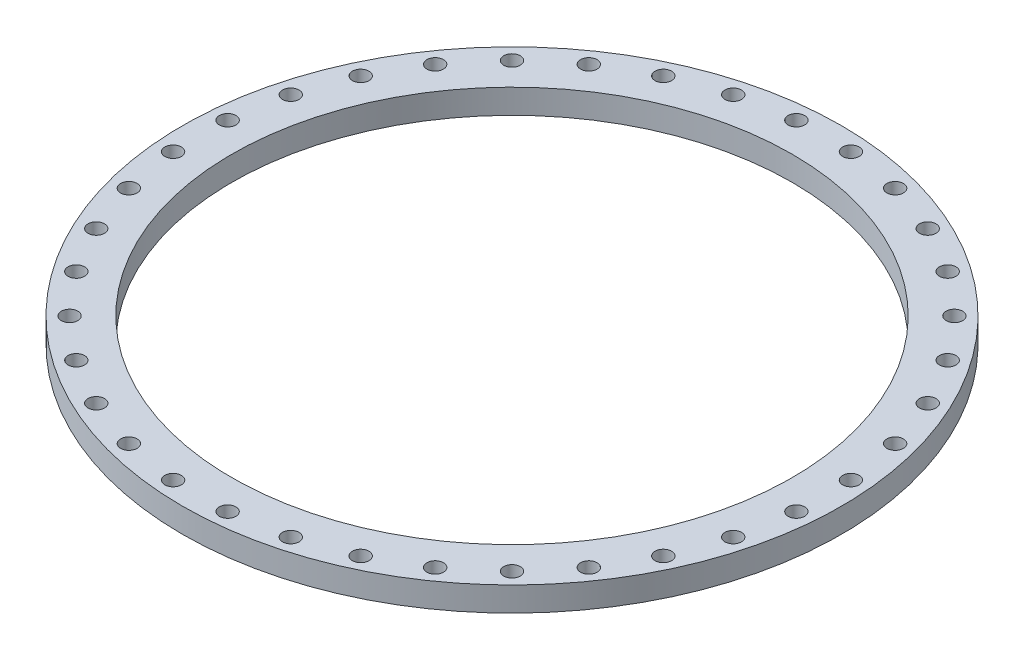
from build123d import *

# Parameters (mm, degrees)
ESQUISSE1_W                     = 125.5
ESQUISSE1_H                     = 62
DIAM_TRE_DU_PER_AGE_18_0_18_1_D = 42
R_P_TITION_CIRCULAIRE1_COUNT    = 36


with BuildPart() as part:
    # Esquisse1 → R_volution1 (revolve)
    with BuildSketch(Plane.XY, mode=Mode.PRIVATE) as r_volution1_sk:
        with Locations((-774.75, 31)):
            Rectangle(ESQUISSE1_W, ESQUISSE1_H)
    revolve(r_volution1_sk.sketch.rotate(Axis((0, 0, 0), (0, 1, 0)), 270), axis=Axis((0, 0, 0), (0, 1, 0)))

    # Diam_tre du per_age _18.0 _18_1 (through all)
    with Locations(Plane(origin=(0, 62, 0), x_dir=(1, 0, 0), z_dir=(0, 1, 0))):
        with Locations((69.288815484, 791.974784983)):
            diam_tre_du_per_age_18_0_18_1 = Hole(DIAM_TRE_DU_PER_AGE_18_0_18_1_D / 2)

    # R_p_tition circulaire1: Diam_tre du per_age _18.0 _18_1 ×36 about axis
    r_p_tition_circulaire1_axis = Axis((0, 0, 0), (0, 1, 0))
    for i in range(1, R_P_TITION_CIRCULAIRE1_COUNT):
        add(diam_tre_du_per_age_18_0_18_1.rotate(r_p_tition_circulaire1_axis, i * 360 / R_P_TITION_CIRCULAIRE1_COUNT), mode=Mode.SUBTRACT)


solid = part.part
